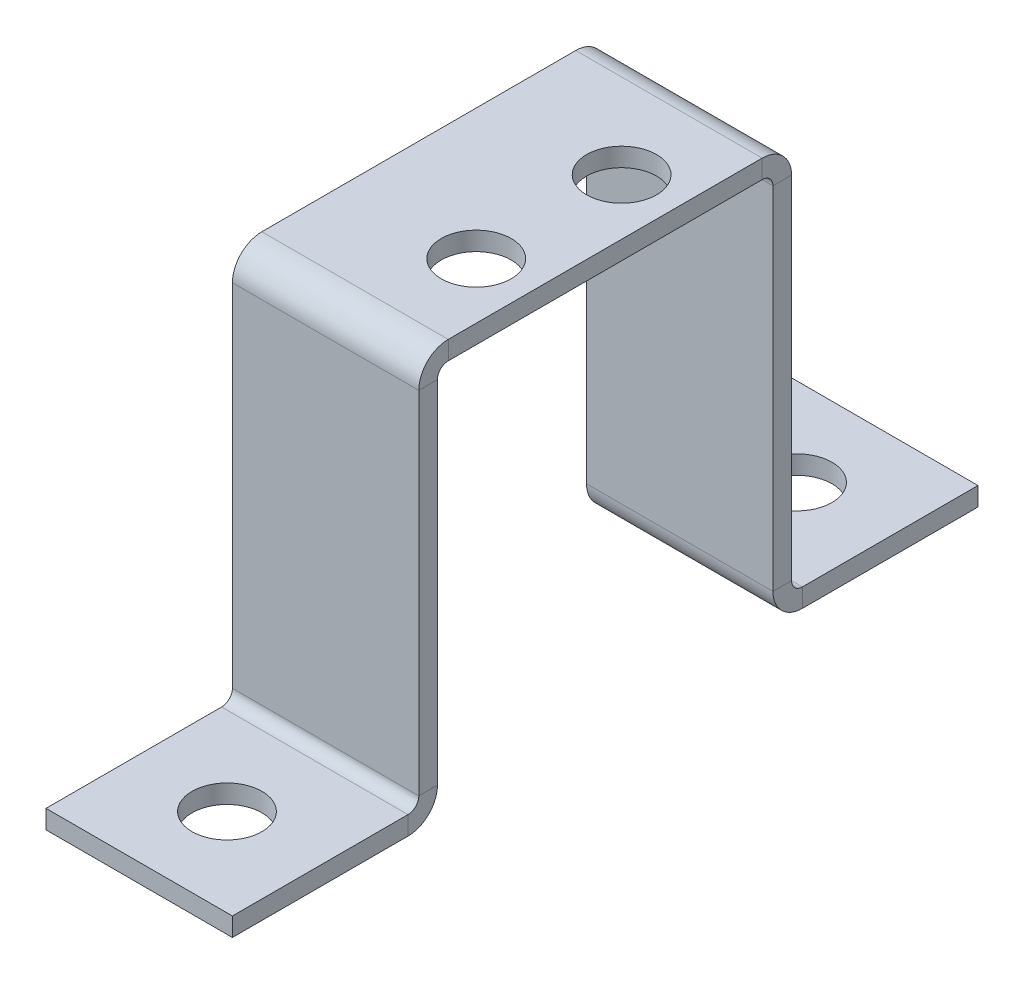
ISO-10303-21;
HEADER;
FILE_DESCRIPTION(('STEP AP214'),'2;1');
FILE_NAME('part.step','',(''),(''),'','','');
FILE_SCHEMA(('AUTOMOTIVE_DESIGN { 1 0 10303 214 1 1 1 1 }'));
ENDSEC;
DATA;
#1=APPLICATION_CONTEXT('core data for automotive mechanical design processes');
#2=APPLICATION_PROTOCOL_DEFINITION('international standard','automotive_design',2000,#1);
#3=PRODUCT_CONTEXT('',#1,'mechanical');
#4=PRODUCT('Part','Part','',(#3));
#5=PRODUCT_RELATED_PRODUCT_CATEGORY('part','',(#4));
#6=PRODUCT_DEFINITION_FORMATION('','',#4);
#7=PRODUCT_DEFINITION_CONTEXT('part definition',#1,'design');
#8=PRODUCT_DEFINITION('design','',#6,#7);
#9=PRODUCT_DEFINITION_SHAPE('','',#8);
#10=(LENGTH_UNIT() NAMED_UNIT(*) SI_UNIT(.MILLI.,.METRE.));
#11=(NAMED_UNIT(*) PLANE_ANGLE_UNIT() SI_UNIT($,.RADIAN.));
#12=(NAMED_UNIT(*) SI_UNIT($,.STERADIAN.) SOLID_ANGLE_UNIT());
#13=UNCERTAINTY_MEASURE_WITH_UNIT(LENGTH_MEASURE(1.E-05),#10,'distance_accuracy_value','');
#14=(GEOMETRIC_REPRESENTATION_CONTEXT(3) GLOBAL_UNCERTAINTY_ASSIGNED_CONTEXT((#13)) GLOBAL_UNIT_ASSIGNED_CONTEXT((#10,
#11,#12)) REPRESENTATION_CONTEXT('',''));
#15=CARTESIAN_POINT('',(0.,0.,0.));
#16=DIRECTION('',(0.,0.,1.));
#17=DIRECTION('',(1.,0.,0.));
#18=AXIS2_PLACEMENT_3D('',#15,#16,#17);
#19=CARTESIAN_POINT('',(0.,-27.94,0.));
#20=DIRECTION('',(0.,-1.,0.));
#21=DIRECTION('',(0.,0.,1.));
#22=AXIS2_PLACEMENT_3D('',#19,#20,#21);
#23=PLANE('',#22);
#24=DIRECTION('',(0.,0.,1.));
#25=VECTOR('',#24,1.);
#26=CARTESIAN_POINT('',(6.35,-27.94,-12.7000000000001));
#27=LINE('',#26,#25);
#28=CARTESIAN_POINT('',(6.35,-27.94,-25.4000000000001));
#29=VERTEX_POINT('',#28);
#30=CARTESIAN_POINT('',(6.35,-27.94,-13.4366000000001));
#31=VERTEX_POINT('',#30);
#32=EDGE_CURVE('E178',#29,#31,#27,.T.);
#33=ORIENTED_EDGE('',*,*,#32,.T.);
#34=DIRECTION('',(-1.,0.,0.));
#35=VECTOR('',#34,1.);
#36=CARTESIAN_POINT('',(0.,-27.94,-13.4366000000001));
#37=LINE('',#36,#35);
#38=CARTESIAN_POINT('',(-6.35,-27.94,-13.4366000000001));
#39=VERTEX_POINT('',#38);
#40=EDGE_CURVE('E202',#31,#39,#37,.T.);
#41=ORIENTED_EDGE('',*,*,#40,.T.);
#42=DIRECTION('',(0.,0.,-1.));
#43=VECTOR('',#42,1.);
#44=CARTESIAN_POINT('',(-6.35,-27.94,-25.4000000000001));
#45=LINE('',#44,#43);
#46=CARTESIAN_POINT('',(-6.35,-27.94,-25.4000000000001));
#47=VERTEX_POINT('',#46);
#48=EDGE_CURVE('E180',#39,#47,#45,.T.);
#49=ORIENTED_EDGE('',*,*,#48,.T.);
#50=DIRECTION('',(1.,0.,0.));
#51=VECTOR('',#50,1.);
#52=CARTESIAN_POINT('',(6.35,-27.94,-25.4000000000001));
#53=LINE('',#52,#51);
#54=EDGE_CURVE('E173',#47,#29,#53,.T.);
#55=ORIENTED_EDGE('',*,*,#54,.T.);
#56=EDGE_LOOP('',(#33,#41,#49,#55));
#57=FACE_BOUND('',#56,.T.);
#58=CARTESIAN_POINT('',(0.,-27.94,-19.4183000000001));
#59=DIRECTION('',(0.,-1.,0.));
#60=DIRECTION('',(0.,0.,-1.));
#61=AXIS2_PLACEMENT_3D('',#58,#59,#60);
#62=CIRCLE('',#61,2.38125);
#63=CARTESIAN_POINT('',(0.,-27.94,-21.7995500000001));
#64=VERTEX_POINT('',#63);
#65=EDGE_CURVE('E946',#64,#64,#62,.T.);
#66=ORIENTED_EDGE('',*,*,#65,.F.);
#67=EDGE_LOOP('',(#66));
#68=FACE_BOUND('',#67,.T.);
#69=ADVANCED_FACE('F35',(#57,#68),#23,.T.);
#70=CARTESIAN_POINT('',(0.,-26.67,0.));
#71=DIRECTION('',(0.,-1.,0.));
#72=DIRECTION('',(0.,0.,1.));
#73=AXIS2_PLACEMENT_3D('',#70,#71,#72);
#74=PLANE('',#73);
#75=DIRECTION('',(-1.,0.,0.));
#76=VECTOR('',#75,1.);
#77=CARTESIAN_POINT('',(6.35,-26.67,-13.4366000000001));
#78=LINE('',#77,#76);
#79=CARTESIAN_POINT('',(6.35,-26.67,-13.4366000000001));
#80=VERTEX_POINT('',#79);
#81=CARTESIAN_POINT('',(-6.35,-26.67,-13.4366000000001));
#82=VERTEX_POINT('',#81);
#83=EDGE_CURVE('E457',#80,#82,#78,.T.);
#84=ORIENTED_EDGE('',*,*,#83,.F.);
#85=DIRECTION('',(0.,0.,1.));
#86=VECTOR('',#85,1.);
#87=CARTESIAN_POINT('',(6.35,-26.67,-12.7000000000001));
#88=LINE('',#87,#86);
#89=CARTESIAN_POINT('',(6.35,-26.67,-25.4000000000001));
#90=VERTEX_POINT('',#89);
#91=EDGE_CURVE('E206',#90,#80,#88,.T.);
#92=ORIENTED_EDGE('',*,*,#91,.F.);
#93=DIRECTION('',(1.,0.,0.));
#94=VECTOR('',#93,1.);
#95=CARTESIAN_POINT('',(6.35,-26.67,-25.4000000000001));
#96=LINE('',#95,#94);
#97=CARTESIAN_POINT('',(-6.35,-26.67,-25.4000000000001));
#98=VERTEX_POINT('',#97);
#99=EDGE_CURVE('E189',#98,#90,#96,.T.);
#100=ORIENTED_EDGE('',*,*,#99,.F.);
#101=DIRECTION('',(0.,0.,-1.));
#102=VECTOR('',#101,1.);
#103=CARTESIAN_POINT('',(-6.35,-26.67,-25.4000000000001));
#104=LINE('',#103,#102);
#105=EDGE_CURVE('E198',#82,#98,#104,.T.);
#106=ORIENTED_EDGE('',*,*,#105,.F.);
#107=EDGE_LOOP('',(#84,#92,#100,#106));
#108=FACE_BOUND('',#107,.T.);
#109=CARTESIAN_POINT('',(0.,-26.67,-19.4183000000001));
#110=DIRECTION('',(0.,-1.,0.));
#111=DIRECTION('',(0.,0.,-1.));
#112=AXIS2_PLACEMENT_3D('',#109,#110,#111);
#113=CIRCLE('',#112,2.38125);
#114=CARTESIAN_POINT('',(0.,-26.67,-21.7995500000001));
#115=VERTEX_POINT('',#114);
#116=EDGE_CURVE('E940',#115,#115,#113,.T.);
#117=ORIENTED_EDGE('',*,*,#116,.T.);
#118=EDGE_LOOP('',(#117));
#119=FACE_BOUND('',#118,.T.);
#120=ADVANCED_FACE('F483',(#108,#119),#74,.F.);
#121=CARTESIAN_POINT('',(-6.35,-26.67,-12.7000000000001));
#122=DIRECTION('',(-1.,0.,0.));
#123=DIRECTION('',(0.,0.,1.));
#124=AXIS2_PLACEMENT_3D('',#121,#122,#123);
#125=PLANE('',#124);
#126=DIRECTION('',(0.,-1.,0.));
#127=VECTOR('',#126,1.);
#128=CARTESIAN_POINT('',(-6.35,-26.67,-12.7000000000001));
#129=LINE('',#128,#127);
#130=CARTESIAN_POINT('',(-6.35,-2.0066,-12.7));
#131=VERTEX_POINT('',#130);
#132=CARTESIAN_POINT('',(-6.35,-25.9334,-12.7000000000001));
#133=VERTEX_POINT('',#132);
#134=EDGE_CURVE('E242',#131,#133,#129,.T.);
#135=ORIENTED_EDGE('',*,*,#134,.T.);
#136=DIRECTION('',(0.,0.,1.));
#137=VECTOR('',#136,1.);
#138=CARTESIAN_POINT('',(-6.35,-25.9334,-12.7000000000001));
#139=LINE('',#138,#137);
#140=CARTESIAN_POINT('',(-6.35,-25.9334,-11.4300000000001));
#141=VERTEX_POINT('',#140);
#142=EDGE_CURVE('E216',#133,#141,#139,.T.);
#143=ORIENTED_EDGE('',*,*,#142,.T.);
#144=DIRECTION('',(0.,-1.,0.));
#145=VECTOR('',#144,1.);
#146=CARTESIAN_POINT('',(-6.35,-26.67,-11.4300000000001));
#147=LINE('',#146,#145);
#148=CARTESIAN_POINT('',(-6.35,-2.0066,-11.43));
#149=VERTEX_POINT('',#148);
#150=EDGE_CURVE('E241',#149,#141,#147,.T.);
#151=ORIENTED_EDGE('',*,*,#150,.F.);
#152=DIRECTION('',(0.,0.,-1.));
#153=VECTOR('',#152,1.);
#154=CARTESIAN_POINT('',(-6.35,-2.0066,-11.43));
#155=LINE('',#154,#153);
#156=EDGE_CURVE('E228',#149,#131,#155,.T.);
#157=ORIENTED_EDGE('',*,*,#156,.T.);
#158=EDGE_LOOP('',(#135,#143,#151,#157));
#159=FACE_BOUND('',#158,.T.);
#160=ADVANCED_FACE('F445',(#159),#125,.T.);
#161=CARTESIAN_POINT('',(0.,0.,-12.7));
#162=DIRECTION('',(0.,0.,1.));
#163=DIRECTION('',(0.,1.,0.));
#164=AXIS2_PLACEMENT_3D('',#161,#162,#163);
#165=PLANE('',#164);
#166=DIRECTION('',(-1.,0.,0.));
#167=VECTOR('',#166,1.);
#168=CARTESIAN_POINT('',(-6.35,-25.9334,-12.7000000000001));
#169=LINE('',#168,#167);
#170=CARTESIAN_POINT('',(6.35,-25.9334,-12.7000000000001));
#171=VERTEX_POINT('',#170);
#172=EDGE_CURVE('E222',#133,#171,#169,.F.);
#173=ORIENTED_EDGE('',*,*,#172,.F.);
#174=ORIENTED_EDGE('',*,*,#134,.F.);
#175=DIRECTION('',(-1.,0.,0.));
#176=VECTOR('',#175,1.);
#177=CARTESIAN_POINT('',(0.,-2.00659999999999,-12.7));
#178=LINE('',#177,#176);
#179=CARTESIAN_POINT('',(6.35,-2.00659999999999,-12.7));
#180=VERTEX_POINT('',#179);
#181=EDGE_CURVE('E237',#180,#131,#178,.T.);
#182=ORIENTED_EDGE('',*,*,#181,.F.);
#183=DIRECTION('',(0.,1.,0.));
#184=VECTOR('',#183,1.);
#185=CARTESIAN_POINT('',(6.35,-1.27,-12.7));
#186=LINE('',#185,#184);
#187=EDGE_CURVE('E245',#171,#180,#186,.T.);
#188=ORIENTED_EDGE('',*,*,#187,.F.);
#189=EDGE_LOOP('',(#173,#174,#182,#188));
#190=FACE_BOUND('',#189,.T.);
#191=ADVANCED_FACE('F460',(#190),#165,.F.);
#192=CARTESIAN_POINT('',(0.,0.,-11.43));
#193=DIRECTION('',(0.,0.,1.));
#194=DIRECTION('',(0.,1.,0.));
#195=AXIS2_PLACEMENT_3D('',#192,#193,#194);
#196=PLANE('',#195);
#197=ORIENTED_EDGE('',*,*,#150,.T.);
#198=DIRECTION('',(-1.,0.,0.));
#199=VECTOR('',#198,1.);
#200=CARTESIAN_POINT('',(-6.35,-25.9334,-11.4300000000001));
#201=LINE('',#200,#199);
#202=CARTESIAN_POINT('',(6.35,-25.9334,-11.4300000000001));
#203=VERTEX_POINT('',#202);
#204=EDGE_CURVE('E211',#141,#203,#201,.F.);
#205=ORIENTED_EDGE('',*,*,#204,.T.);
#206=DIRECTION('',(0.,1.,0.));
#207=VECTOR('',#206,1.);
#208=CARTESIAN_POINT('',(6.35,-1.27,-11.43));
#209=LINE('',#208,#207);
#210=CARTESIAN_POINT('',(6.35,-2.0066,-11.43));
#211=VERTEX_POINT('',#210);
#212=EDGE_CURVE('E246',#203,#211,#209,.T.);
#213=ORIENTED_EDGE('',*,*,#212,.T.);
#214=DIRECTION('',(1.,0.,0.));
#215=VECTOR('',#214,1.);
#216=CARTESIAN_POINT('',(-6.35,-2.0066,-11.43));
#217=LINE('',#216,#215);
#218=EDGE_CURVE('E231',#149,#211,#217,.T.);
#219=ORIENTED_EDGE('',*,*,#218,.F.);
#220=EDGE_LOOP('',(#197,#205,#213,#219));
#221=FACE_BOUND('',#220,.T.);
#222=ADVANCED_FACE('F442',(#221),#196,.T.);
#223=CARTESIAN_POINT('',(0.,-1.27,0.));
#224=DIRECTION('',(0.,-1.,0.));
#225=DIRECTION('',(0.,0.,-1.));
#226=AXIS2_PLACEMENT_3D('',#223,#224,#225);
#227=PLANE('',#226);
#228=CARTESIAN_POINT('',(2.54,-1.27,-4.9276));
#229=DIRECTION('',(0.,-1.,0.));
#230=DIRECTION('',(0.,0.,-1.));
#231=AXIS2_PLACEMENT_3D('',#228,#229,#230);
#232=CIRCLE('',#231,2.38125);
#233=CARTESIAN_POINT('',(2.54,-1.27,-7.30885));
#234=VERTEX_POINT('',#233);
#235=EDGE_CURVE('E937',#234,#234,#232,.F.);
#236=ORIENTED_EDGE('',*,*,#235,.T.);
#237=EDGE_LOOP('',(#236));
#238=FACE_BOUND('',#237,.T.);
#239=CARTESIAN_POINT('',(2.54,-1.27,4.9784));
#240=DIRECTION('',(0.,-1.,0.));
#241=DIRECTION('',(0.,0.,-1.));
#242=AXIS2_PLACEMENT_3D('',#239,#240,#241);
#243=CIRCLE('',#242,2.38125);
#244=CARTESIAN_POINT('',(2.54,-1.27,2.59715));
#245=VERTEX_POINT('',#244);
#246=EDGE_CURVE('E936',#245,#245,#243,.F.);
#247=ORIENTED_EDGE('',*,*,#246,.T.);
#248=EDGE_LOOP('',(#247));
#249=FACE_BOUND('',#248,.T.);
#250=DIRECTION('',(0.,0.,1.));
#251=VECTOR('',#250,1.);
#252=CARTESIAN_POINT('',(-6.35,-1.27,11.43));
#253=LINE('',#252,#251);
#254=CARTESIAN_POINT('',(-6.35,-1.27,-10.6934));
#255=VERTEX_POINT('',#254);
#256=CARTESIAN_POINT('',(-6.35,-1.27,10.6934));
#257=VERTEX_POINT('',#256);
#258=EDGE_CURVE('E11',#255,#257,#253,.T.);
#259=ORIENTED_EDGE('',*,*,#258,.F.);
#260=DIRECTION('',(1.,0.,0.));
#261=VECTOR('',#260,1.);
#262=CARTESIAN_POINT('',(6.35,-1.27,-10.6934));
#263=LINE('',#262,#261);
#264=CARTESIAN_POINT('',(6.35,-1.27,-10.6934));
#265=VERTEX_POINT('',#264);
#266=EDGE_CURVE('E264',#265,#255,#263,.F.);
#267=ORIENTED_EDGE('',*,*,#266,.F.);
#268=DIRECTION('',(0.,0.,-1.));
#269=VECTOR('',#268,1.);
#270=CARTESIAN_POINT('',(6.35,-1.27,11.43));
#271=LINE('',#270,#269);
#272=CARTESIAN_POINT('',(6.35,-1.27,10.6934));
#273=VERTEX_POINT('',#272);
#274=EDGE_CURVE('E44',#273,#265,#271,.T.);
#275=ORIENTED_EDGE('',*,*,#274,.F.);
#276=DIRECTION('',(-1.,0.,0.));
#277=VECTOR('',#276,1.);
#278=CARTESIAN_POINT('',(-6.35,-1.27,10.6934));
#279=LINE('',#278,#277);
#280=EDGE_CURVE('E366',#257,#273,#279,.F.);
#281=ORIENTED_EDGE('',*,*,#280,.F.);
#282=EDGE_LOOP('',(#259,#267,#275,#281));
#283=FACE_BOUND('',#282,.T.);
#284=ADVANCED_FACE('F428',(#238,#249,#283),#227,.T.);
#285=CARTESIAN_POINT('',(0.,0.,0.));
#286=DIRECTION('',(0.,-1.,0.));
#287=DIRECTION('',(0.,0.,-1.));
#288=AXIS2_PLACEMENT_3D('',#285,#286,#287);
#289=PLANE('',#288);
#290=CARTESIAN_POINT('',(2.54,0.,-4.9276));
#291=DIRECTION('',(0.,1.,0.));
#292=DIRECTION('',(0.,0.,1.));
#293=AXIS2_PLACEMENT_3D('',#290,#291,#292);
#294=CIRCLE('',#293,2.38125);
#295=CARTESIAN_POINT('',(2.54,0.,-2.54635));
#296=VERTEX_POINT('',#295);
#297=EDGE_CURVE('E932',#296,#296,#294,.T.);
#298=ORIENTED_EDGE('',*,*,#297,.F.);
#299=EDGE_LOOP('',(#298));
#300=FACE_BOUND('',#299,.T.);
#301=CARTESIAN_POINT('',(2.54,0.,4.9784));
#302=DIRECTION('',(0.,1.,0.));
#303=DIRECTION('',(0.,0.,1.));
#304=AXIS2_PLACEMENT_3D('',#301,#302,#303);
#305=CIRCLE('',#304,2.38125);
#306=CARTESIAN_POINT('',(2.54,0.,7.35965));
#307=VERTEX_POINT('',#306);
#308=EDGE_CURVE('E935',#307,#307,#305,.T.);
#309=ORIENTED_EDGE('',*,*,#308,.F.);
#310=EDGE_LOOP('',(#309));
#311=FACE_BOUND('',#310,.T.);
#312=DIRECTION('',(1.,0.,0.));
#313=VECTOR('',#312,1.);
#314=CARTESIAN_POINT('',(6.35,0.,-10.6934));
#315=LINE('',#314,#313);
#316=CARTESIAN_POINT('',(6.35,0.,-10.6934));
#317=VERTEX_POINT('',#316);
#318=CARTESIAN_POINT('',(-6.35,0.,-10.6934));
#319=VERTEX_POINT('',#318);
#320=EDGE_CURVE('E252',#317,#319,#315,.F.);
#321=ORIENTED_EDGE('',*,*,#320,.T.);
#322=DIRECTION('',(0.,0.,1.));
#323=VECTOR('',#322,1.);
#324=CARTESIAN_POINT('',(-6.35,0.,11.43));
#325=LINE('',#324,#323);
#326=CARTESIAN_POINT('',(-6.35,0.,10.6934));
#327=VERTEX_POINT('',#326);
#328=EDGE_CURVE('E39',#319,#327,#325,.T.);
#329=ORIENTED_EDGE('',*,*,#328,.T.);
#330=DIRECTION('',(-1.,0.,0.));
#331=VECTOR('',#330,1.);
#332=CARTESIAN_POINT('',(-6.35,0.,10.6934));
#333=LINE('',#332,#331);
#334=CARTESIAN_POINT('',(6.35,0.,10.6934));
#335=VERTEX_POINT('',#334);
#336=EDGE_CURVE('E354',#327,#335,#333,.F.);
#337=ORIENTED_EDGE('',*,*,#336,.T.);
#338=DIRECTION('',(0.,0.,-1.));
#339=VECTOR('',#338,1.);
#340=CARTESIAN_POINT('',(6.35,0.,11.43));
#341=LINE('',#340,#339);
#342=EDGE_CURVE('E374',#335,#317,#341,.T.);
#343=ORIENTED_EDGE('',*,*,#342,.T.);
#344=EDGE_LOOP('',(#321,#329,#337,#343));
#345=FACE_BOUND('',#344,.T.);
#346=ADVANCED_FACE('F381',(#300,#311,#345),#289,.F.);
#347=CARTESIAN_POINT('',(6.35,-1.27,11.43));
#348=DIRECTION('',(1.,0.,0.));
#349=DIRECTION('',(0.,0.,-1.));
#350=AXIS2_PLACEMENT_3D('',#347,#348,#349);
#351=PLANE('',#350);
#352=ORIENTED_EDGE('',*,*,#274,.T.);
#353=DIRECTION('',(0.,1.,0.));
#354=VECTOR('',#353,1.);
#355=CARTESIAN_POINT('',(6.35,-1.27,-10.6934));
#356=LINE('',#355,#354);
#357=EDGE_CURVE('E258',#265,#317,#356,.T.);
#358=ORIENTED_EDGE('',*,*,#357,.T.);
#359=ORIENTED_EDGE('',*,*,#342,.F.);
#360=DIRECTION('',(0.,1.,0.));
#361=VECTOR('',#360,1.);
#362=CARTESIAN_POINT('',(6.35,-1.27,10.6934));
#363=LINE('',#362,#361);
#364=EDGE_CURVE('E371',#273,#335,#363,.T.);
#365=ORIENTED_EDGE('',*,*,#364,.F.);
#366=EDGE_LOOP('',(#352,#358,#359,#365));
#367=FACE_BOUND('',#366,.T.);
#368=ADVANCED_FACE('F37',(#367),#351,.T.);
#369=CARTESIAN_POINT('',(-6.35,-26.67,12.7000000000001));
#370=DIRECTION('',(1.,0.,0.));
#371=DIRECTION('',(0.,0.,-1.));
#372=AXIS2_PLACEMENT_3D('',#369,#370,#371);
#373=PLANE('',#372);
#374=DIRECTION('',(0.,0.,-1.));
#375=VECTOR('',#374,1.);
#376=CARTESIAN_POINT('',(-6.35,-25.9334,12.7000000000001));
#377=LINE('',#376,#375);
#378=CARTESIAN_POINT('',(-6.35,-25.9334,12.7000000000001));
#379=VERTEX_POINT('',#378);
#380=CARTESIAN_POINT('',(-6.35,-25.9334,11.4300000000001));
#381=VERTEX_POINT('',#380);
#382=EDGE_CURVE('E328',#379,#381,#377,.T.);
#383=ORIENTED_EDGE('',*,*,#382,.F.);
#384=DIRECTION('',(0.,-1.,0.));
#385=VECTOR('',#384,1.);
#386=CARTESIAN_POINT('',(-6.35,-26.67,12.7000000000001));
#387=LINE('',#386,#385);
#388=CARTESIAN_POINT('',(-6.35,-2.0066,12.7));
#389=VERTEX_POINT('',#388);
#390=EDGE_CURVE('E344',#389,#379,#387,.T.);
#391=ORIENTED_EDGE('',*,*,#390,.F.);
#392=DIRECTION('',(0.,0.,1.));
#393=VECTOR('',#392,1.);
#394=CARTESIAN_POINT('',(-6.35,-2.0066,11.43));
#395=LINE('',#394,#393);
#396=CARTESIAN_POINT('',(-6.35,-2.00659999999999,11.43));
#397=VERTEX_POINT('',#396);
#398=EDGE_CURVE('E335',#397,#389,#395,.T.);
#399=ORIENTED_EDGE('',*,*,#398,.F.);
#400=DIRECTION('',(0.,-1.,0.));
#401=VECTOR('',#400,1.);
#402=CARTESIAN_POINT('',(-6.35,-26.67,11.4300000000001));
#403=LINE('',#402,#401);
#404=EDGE_CURVE('E343',#397,#381,#403,.T.);
#405=ORIENTED_EDGE('',*,*,#404,.T.);
#406=EDGE_LOOP('',(#383,#391,#399,#405));
#407=FACE_BOUND('',#406,.T.);
#408=ADVANCED_FACE('F405',(#407),#373,.F.);
#409=CARTESIAN_POINT('',(6.35,-1.27,12.7));
#410=DIRECTION('',(-1.,0.,0.));
#411=DIRECTION('',(0.,0.,1.));
#412=AXIS2_PLACEMENT_3D('',#409,#410,#411);
#413=PLANE('',#412);
#414=DIRECTION('',(0.,0.,-1.));
#415=VECTOR('',#414,1.);
#416=CARTESIAN_POINT('',(6.35,-25.9334,12.7000000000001));
#417=LINE('',#416,#415);
#418=CARTESIAN_POINT('',(6.35,-25.9334,12.7000000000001));
#419=VERTEX_POINT('',#418);
#420=CARTESIAN_POINT('',(6.35,-25.9334,11.4300000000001));
#421=VERTEX_POINT('',#420);
#422=EDGE_CURVE('E318',#419,#421,#417,.T.);
#423=ORIENTED_EDGE('',*,*,#422,.T.);
#424=DIRECTION('',(0.,1.,0.));
#425=VECTOR('',#424,1.);
#426=CARTESIAN_POINT('',(6.35,-1.27,11.43));
#427=LINE('',#426,#425);
#428=CARTESIAN_POINT('',(6.35,-2.00659999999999,11.43));
#429=VERTEX_POINT('',#428);
#430=EDGE_CURVE('E348',#421,#429,#427,.T.);
#431=ORIENTED_EDGE('',*,*,#430,.T.);
#432=DIRECTION('',(0.,0.,1.));
#433=VECTOR('',#432,1.);
#434=CARTESIAN_POINT('',(6.35,-2.0066,11.43));
#435=LINE('',#434,#433);
#436=CARTESIAN_POINT('',(6.35,-2.00659999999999,12.7));
#437=VERTEX_POINT('',#436);
#438=EDGE_CURVE('E330',#429,#437,#435,.T.);
#439=ORIENTED_EDGE('',*,*,#438,.T.);
#440=DIRECTION('',(0.,1.,0.));
#441=VECTOR('',#440,1.);
#442=CARTESIAN_POINT('',(6.35,-1.27,12.7));
#443=LINE('',#442,#441);
#444=EDGE_CURVE('E347',#419,#437,#443,.T.);
#445=ORIENTED_EDGE('',*,*,#444,.F.);
#446=EDGE_LOOP('',(#423,#431,#439,#445));
#447=FACE_BOUND('',#446,.T.);
#448=ADVANCED_FACE('F419',(#447),#413,.F.);
#449=CARTESIAN_POINT('',(0.,0.,12.7));
#450=DIRECTION('',(0.,0.,-1.));
#451=DIRECTION('',(0.,1.,0.));
#452=AXIS2_PLACEMENT_3D('',#449,#450,#451);
#453=PLANE('',#452);
#454=DIRECTION('',(1.,0.,0.));
#455=VECTOR('',#454,1.);
#456=CARTESIAN_POINT('',(6.35,-25.9334,12.7000000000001));
#457=LINE('',#456,#455);
#458=EDGE_CURVE('E324',#419,#379,#457,.F.);
#459=ORIENTED_EDGE('',*,*,#458,.F.);
#460=ORIENTED_EDGE('',*,*,#444,.T.);
#461=DIRECTION('',(1.,0.,0.));
#462=VECTOR('',#461,1.);
#463=CARTESIAN_POINT('',(0.,-2.0066,12.7));
#464=LINE('',#463,#462);
#465=EDGE_CURVE('E338',#389,#437,#464,.T.);
#466=ORIENTED_EDGE('',*,*,#465,.F.);
#467=ORIENTED_EDGE('',*,*,#390,.T.);
#468=EDGE_LOOP('',(#459,#460,#466,#467));
#469=FACE_BOUND('',#468,.T.);
#470=ADVANCED_FACE('F402',(#469),#453,.F.);
#471=CARTESIAN_POINT('',(0.,0.,11.43));
#472=DIRECTION('',(0.,0.,-1.));
#473=DIRECTION('',(0.,1.,0.));
#474=AXIS2_PLACEMENT_3D('',#471,#472,#473);
#475=PLANE('',#474);
#476=ORIENTED_EDGE('',*,*,#430,.F.);
#477=DIRECTION('',(1.,0.,0.));
#478=VECTOR('',#477,1.);
#479=CARTESIAN_POINT('',(6.35,-25.9334,11.4300000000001));
#480=LINE('',#479,#478);
#481=EDGE_CURVE('E313',#421,#381,#480,.F.);
#482=ORIENTED_EDGE('',*,*,#481,.T.);
#483=ORIENTED_EDGE('',*,*,#404,.F.);
#484=DIRECTION('',(-1.,0.,0.));
#485=VECTOR('',#484,1.);
#486=CARTESIAN_POINT('',(6.35,-2.0066,11.43));
#487=LINE('',#486,#485);
#488=EDGE_CURVE('E333',#429,#397,#487,.T.);
#489=ORIENTED_EDGE('',*,*,#488,.F.);
#490=EDGE_LOOP('',(#476,#482,#483,#489));
#491=FACE_BOUND('',#490,.T.);
#492=ADVANCED_FACE('F411',(#491),#475,.T.);
#493=CARTESIAN_POINT('',(-6.35,-1.27,11.43));
#494=DIRECTION('',(-1.,0.,0.));
#495=DIRECTION('',(0.,0.,1.));
#496=AXIS2_PLACEMENT_3D('',#493,#494,#495);
#497=PLANE('',#496);
#498=DIRECTION('',(0.,1.,0.));
#499=VECTOR('',#498,1.);
#500=CARTESIAN_POINT('',(-6.35,-1.27,-10.6934));
#501=LINE('',#500,#499);
#502=EDGE_CURVE('E269',#255,#319,#501,.T.);
#503=ORIENTED_EDGE('',*,*,#502,.F.);
#504=ORIENTED_EDGE('',*,*,#258,.T.);
#505=DIRECTION('',(0.,1.,0.));
#506=VECTOR('',#505,1.);
#507=CARTESIAN_POINT('',(-6.35,-1.27,10.6934));
#508=LINE('',#507,#506);
#509=EDGE_CURVE('E360',#257,#327,#508,.T.);
#510=ORIENTED_EDGE('',*,*,#509,.T.);
#511=ORIENTED_EDGE('',*,*,#328,.F.);
#512=EDGE_LOOP('',(#503,#504,#510,#511));
#513=FACE_BOUND('',#512,.T.);
#514=ADVANCED_FACE('F386',(#513),#497,.T.);
#515=CARTESIAN_POINT('',(6.35,-2.0066,10.6934));
#516=DIRECTION('',(1.,0.,0.));
#517=DIRECTION('',(0.,0.,-1.));
#518=AXIS2_PLACEMENT_3D('',#515,#516,#517);
#519=PLANE('',#518);
#520=ORIENTED_EDGE('',*,*,#438,.F.);
#521=CARTESIAN_POINT('',(6.35,-2.0066,10.6934));
#522=DIRECTION('',(-1.,0.,0.));
#523=DIRECTION('',(0.,0.,1.));
#524=AXIS2_PLACEMENT_3D('',#521,#522,#523);
#525=CIRCLE('',#524,0.7366);
#526=EDGE_CURVE('E363',#273,#429,#525,.F.);
#527=ORIENTED_EDGE('',*,*,#526,.F.);
#528=ORIENTED_EDGE('',*,*,#364,.T.);
#529=CARTESIAN_POINT('',(6.35,-2.0066,10.6934));
#530=DIRECTION('',(-1.,0.,0.));
#531=DIRECTION('',(0.,0.,1.));
#532=AXIS2_PLACEMENT_3D('',#529,#530,#531);
#533=CIRCLE('',#532,2.0066);
#534=EDGE_CURVE('E356',#335,#437,#533,.F.);
#535=ORIENTED_EDGE('',*,*,#534,.T.);
#536=EDGE_LOOP('',(#520,#527,#528,#535));
#537=FACE_BOUND('',#536,.T.);
#538=ADVANCED_FACE('F423',(#537),#519,.T.);
#539=CARTESIAN_POINT('',(-6.35,-2.0066,10.6934));
#540=DIRECTION('',(1.,0.,0.));
#541=DIRECTION('',(0.,0.,-1.));
#542=AXIS2_PLACEMENT_3D('',#539,#540,#541);
#543=PLANE('',#542);
#544=CARTESIAN_POINT('',(-6.35,-2.0066,10.6934));
#545=DIRECTION('',(-1.,0.,0.));
#546=DIRECTION('',(0.,0.,1.));
#547=AXIS2_PLACEMENT_3D('',#544,#545,#546);
#548=CIRCLE('',#547,0.7366);
#549=EDGE_CURVE('E350',#397,#257,#548,.T.);
#550=ORIENTED_EDGE('',*,*,#549,.F.);
#551=ORIENTED_EDGE('',*,*,#398,.T.);
#552=CARTESIAN_POINT('',(-6.35,-2.0066,10.6934));
#553=DIRECTION('',(-1.,0.,0.));
#554=DIRECTION('',(0.,0.,1.));
#555=AXIS2_PLACEMENT_3D('',#552,#553,#554);
#556=CIRCLE('',#555,2.0066);
#557=EDGE_CURVE('E357',#389,#327,#556,.T.);
#558=ORIENTED_EDGE('',*,*,#557,.T.);
#559=ORIENTED_EDGE('',*,*,#509,.F.);
#560=EDGE_LOOP('',(#550,#551,#558,#559));
#561=FACE_BOUND('',#560,.T.);
#562=ADVANCED_FACE('F394',(#561),#543,.F.);
#563=CARTESIAN_POINT('',(-6.35,-2.0066,10.6934));
#564=DIRECTION('',(-1.,0.,0.));
#565=DIRECTION('',(0.,0.,1.));
#566=AXIS2_PLACEMENT_3D('',#563,#564,#565);
#567=CYLINDRICAL_SURFACE('',#566,2.0066);
#568=ORIENTED_EDGE('',*,*,#336,.F.);
#569=ORIENTED_EDGE('',*,*,#557,.F.);
#570=ORIENTED_EDGE('',*,*,#465,.T.);
#571=ORIENTED_EDGE('',*,*,#534,.F.);
#572=EDGE_LOOP('',(#568,#569,#570,#571));
#573=FACE_BOUND('',#572,.T.);
#574=ADVANCED_FACE('F393',(#573),#567,.T.);
#575=CARTESIAN_POINT('',(-6.35,-2.0066,10.6934));
#576=DIRECTION('',(-1.,0.,0.));
#577=DIRECTION('',(0.,0.,1.));
#578=AXIS2_PLACEMENT_3D('',#575,#576,#577);
#579=CYLINDRICAL_SURFACE('',#578,0.7366);
#580=ORIENTED_EDGE('',*,*,#280,.T.);
#581=ORIENTED_EDGE('',*,*,#526,.T.);
#582=ORIENTED_EDGE('',*,*,#488,.T.);
#583=ORIENTED_EDGE('',*,*,#549,.T.);
#584=EDGE_LOOP('',(#580,#581,#582,#583));
#585=FACE_BOUND('',#584,.T.);
#586=ADVANCED_FACE('F425',(#585),#579,.F.);
#587=CARTESIAN_POINT('',(-6.35,-25.9334,13.4366000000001));
#588=DIRECTION('',(-1.,0.,0.));
#589=DIRECTION('',(0.,0.,1.));
#590=AXIS2_PLACEMENT_3D('',#587,#588,#589);
#591=PLANE('',#590);
#592=DIRECTION('',(0.,-1.,0.));
#593=VECTOR('',#592,1.);
#594=CARTESIAN_POINT('',(-6.35,-26.67,13.4366000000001));
#595=LINE('',#594,#593);
#596=CARTESIAN_POINT('',(-6.35,-26.67,13.4366000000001));
#597=VERTEX_POINT('',#596);
#598=CARTESIAN_POINT('',(-6.35,-27.94,13.4366000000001));
#599=VERTEX_POINT('',#598);
#600=EDGE_CURVE('E278',#597,#599,#595,.T.);
#601=ORIENTED_EDGE('',*,*,#600,.F.);
#602=CARTESIAN_POINT('',(-6.35,-25.9334,13.4366000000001));
#603=DIRECTION('',(1.,0.,0.));
#604=DIRECTION('',(0.,0.,-1.));
#605=AXIS2_PLACEMENT_3D('',#602,#603,#604);
#606=CIRCLE('',#605,0.736599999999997);
#607=EDGE_CURVE('E321',#379,#597,#606,.F.);
#608=ORIENTED_EDGE('',*,*,#607,.F.);
#609=ORIENTED_EDGE('',*,*,#382,.T.);
#610=CARTESIAN_POINT('',(-6.35,-25.9334,13.4366000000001));
#611=DIRECTION('',(1.,0.,0.));
#612=DIRECTION('',(0.,0.,-1.));
#613=AXIS2_PLACEMENT_3D('',#610,#611,#612);
#614=CIRCLE('',#613,2.0066);
#615=EDGE_CURVE('E60',#381,#599,#614,.F.);
#616=ORIENTED_EDGE('',*,*,#615,.T.);
#617=EDGE_LOOP('',(#601,#608,#609,#616));
#618=FACE_BOUND('',#617,.T.);
#619=ADVANCED_FACE('F408',(#618),#591,.T.);
#620=CARTESIAN_POINT('',(6.35,-25.9334,13.4366000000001));
#621=DIRECTION('',(-1.,0.,0.));
#622=DIRECTION('',(0.,0.,1.));
#623=AXIS2_PLACEMENT_3D('',#620,#621,#622);
#624=PLANE('',#623);
#625=CARTESIAN_POINT('',(6.35,-25.9334,13.4366000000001));
#626=DIRECTION('',(1.,0.,0.));
#627=DIRECTION('',(0.,0.,-1.));
#628=AXIS2_PLACEMENT_3D('',#625,#626,#627);
#629=CIRCLE('',#628,0.736599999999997);
#630=CARTESIAN_POINT('',(6.35,-26.67,13.4366000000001));
#631=VERTEX_POINT('',#630);
#632=EDGE_CURVE('E310',#631,#419,#629,.T.);
#633=ORIENTED_EDGE('',*,*,#632,.F.);
#634=DIRECTION('',(0.,-1.,0.));
#635=VECTOR('',#634,1.);
#636=CARTESIAN_POINT('',(6.35,-26.67,13.4366000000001));
#637=LINE('',#636,#635);
#638=CARTESIAN_POINT('',(6.35,-27.94,13.4366000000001));
#639=VERTEX_POINT('',#638);
#640=EDGE_CURVE('E283',#631,#639,#637,.T.);
#641=ORIENTED_EDGE('',*,*,#640,.T.);
#642=CARTESIAN_POINT('',(6.35,-25.9334,13.4366000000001));
#643=DIRECTION('',(1.,0.,0.));
#644=DIRECTION('',(0.,0.,-1.));
#645=AXIS2_PLACEMENT_3D('',#642,#643,#644);
#646=CIRCLE('',#645,2.0066);
#647=EDGE_CURVE('E316',#639,#421,#646,.T.);
#648=ORIENTED_EDGE('',*,*,#647,.T.);
#649=ORIENTED_EDGE('',*,*,#422,.F.);
#650=EDGE_LOOP('',(#633,#641,#648,#649));
#651=FACE_BOUND('',#650,.T.);
#652=ADVANCED_FACE('F416',(#651),#624,.F.);
#653=CARTESIAN_POINT('',(6.35,-25.9334,13.4366000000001));
#654=DIRECTION('',(1.,0.,0.));
#655=DIRECTION('',(0.,-1.,0.));
#656=AXIS2_PLACEMENT_3D('',#653,#654,#655);
#657=CYLINDRICAL_SURFACE('',#656,2.0066);
#658=ORIENTED_EDGE('',*,*,#481,.F.);
#659=ORIENTED_EDGE('',*,*,#647,.F.);
#660=DIRECTION('',(1.,0.,0.));
#661=VECTOR('',#660,1.);
#662=CARTESIAN_POINT('',(0.,-27.94,13.4366000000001));
#663=LINE('',#662,#661);
#664=EDGE_CURVE('E286',#599,#639,#663,.T.);
#665=ORIENTED_EDGE('',*,*,#664,.F.);
#666=ORIENTED_EDGE('',*,*,#615,.F.);
#667=EDGE_LOOP('',(#658,#659,#665,#666));
#668=FACE_BOUND('',#667,.T.);
#669=ADVANCED_FACE('F413',(#668),#657,.T.);
#670=CARTESIAN_POINT('',(6.35,-25.9334,13.4366000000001));
#671=DIRECTION('',(1.,0.,0.));
#672=DIRECTION('',(0.,-1.,0.));
#673=AXIS2_PLACEMENT_3D('',#670,#671,#672);
#674=CYLINDRICAL_SURFACE('',#673,0.736599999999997);
#675=ORIENTED_EDGE('',*,*,#458,.T.);
#676=ORIENTED_EDGE('',*,*,#607,.T.);
#677=DIRECTION('',(1.,0.,0.));
#678=VECTOR('',#677,1.);
#679=CARTESIAN_POINT('',(-6.35,-26.67,13.4366000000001));
#680=LINE('',#679,#678);
#681=EDGE_CURVE('E281',#597,#631,#680,.T.);
#682=ORIENTED_EDGE('',*,*,#681,.T.);
#683=ORIENTED_EDGE('',*,*,#632,.T.);
#684=EDGE_LOOP('',(#675,#676,#682,#683));
#685=FACE_BOUND('',#684,.T.);
#686=ADVANCED_FACE('F764',(#685),#674,.F.);
#687=CARTESIAN_POINT('',(6.35,-27.94,12.7000000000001));
#688=DIRECTION('',(1.,0.,0.));
#689=DIRECTION('',(0.,0.,-1.));
#690=AXIS2_PLACEMENT_3D('',#687,#688,#689);
#691=PLANE('',#690);
#692=DIRECTION('',(0.,0.,-1.));
#693=VECTOR('',#692,1.);
#694=CARTESIAN_POINT('',(6.35,-27.94,12.7000000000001));
#695=LINE('',#694,#693);
#696=CARTESIAN_POINT('',(6.35,-27.94,25.4000000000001));
#697=VERTEX_POINT('',#696);
#698=EDGE_CURVE('E298',#697,#639,#695,.T.);
#699=ORIENTED_EDGE('',*,*,#698,.T.);
#700=ORIENTED_EDGE('',*,*,#640,.F.);
#701=DIRECTION('',(0.,0.,-1.));
#702=VECTOR('',#701,1.);
#703=CARTESIAN_POINT('',(6.35,-26.67,12.7000000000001));
#704=LINE('',#703,#702);
#705=CARTESIAN_POINT('',(6.35,-26.67,25.4000000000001));
#706=VERTEX_POINT('',#705);
#707=EDGE_CURVE('E295',#706,#631,#704,.T.);
#708=ORIENTED_EDGE('',*,*,#707,.F.);
#709=DIRECTION('',(0.,1.,0.));
#710=VECTOR('',#709,1.);
#711=CARTESIAN_POINT('',(6.35,-27.94,25.4000000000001));
#712=LINE('',#711,#710);
#713=EDGE_CURVE('E308',#697,#706,#712,.T.);
#714=ORIENTED_EDGE('',*,*,#713,.F.);
#715=EDGE_LOOP('',(#699,#700,#708,#714));
#716=FACE_BOUND('',#715,.T.);
#717=ADVANCED_FACE('F753',(#716),#691,.T.);
#718=CARTESIAN_POINT('',(-6.35,-27.94,25.4000000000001));
#719=DIRECTION('',(-1.,0.,0.));
#720=DIRECTION('',(0.,0.,1.));
#721=AXIS2_PLACEMENT_3D('',#718,#719,#720);
#722=PLANE('',#721);
#723=DIRECTION('',(0.,0.,1.));
#724=VECTOR('',#723,1.);
#725=CARTESIAN_POINT('',(-6.35,-26.67,25.4000000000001));
#726=LINE('',#725,#724);
#727=CARTESIAN_POINT('',(-6.35,-26.67,25.4000000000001));
#728=VERTEX_POINT('',#727);
#729=EDGE_CURVE('E291',#597,#728,#726,.T.);
#730=ORIENTED_EDGE('',*,*,#729,.F.);
#731=ORIENTED_EDGE('',*,*,#600,.T.);
#732=DIRECTION('',(0.,0.,1.));
#733=VECTOR('',#732,1.);
#734=CARTESIAN_POINT('',(-6.35,-27.94,25.4000000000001));
#735=LINE('',#734,#733);
#736=CARTESIAN_POINT('',(-6.35,-27.94,25.4000000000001));
#737=VERTEX_POINT('',#736);
#738=EDGE_CURVE('E292',#599,#737,#735,.T.);
#739=ORIENTED_EDGE('',*,*,#738,.T.);
#740=DIRECTION('',(0.,1.,0.));
#741=VECTOR('',#740,1.);
#742=CARTESIAN_POINT('',(-6.35,-27.94,25.4000000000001));
#743=LINE('',#742,#741);
#744=EDGE_CURVE('E301',#737,#728,#743,.T.);
#745=ORIENTED_EDGE('',*,*,#744,.T.);
#746=EDGE_LOOP('',(#730,#731,#739,#745));
#747=FACE_BOUND('',#746,.T.);
#748=ADVANCED_FACE('F743',(#747),#722,.T.);
#749=CARTESIAN_POINT('',(0.,-27.94,0.));
#750=DIRECTION('',(0.,-1.,0.));
#751=DIRECTION('',(0.,0.,-1.));
#752=AXIS2_PLACEMENT_3D('',#749,#750,#751);
#753=PLANE('',#752);
#754=CARTESIAN_POINT('',(0.,-27.94,19.4183000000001));
#755=DIRECTION('',(0.,1.,0.));
#756=DIRECTION('',(0.,0.,1.));
#757=AXIS2_PLACEMENT_3D('',#754,#755,#756);
#758=CIRCLE('',#757,2.38125);
#759=CARTESIAN_POINT('',(0.,-27.94,21.7995500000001));
#760=VERTEX_POINT('',#759);
#761=EDGE_CURVE('E275',#760,#760,#758,.T.);
#762=ORIENTED_EDGE('',*,*,#761,.T.);
#763=EDGE_LOOP('',(#762));
#764=FACE_BOUND('',#763,.T.);
#765=ORIENTED_EDGE('',*,*,#738,.F.);
#766=ORIENTED_EDGE('',*,*,#664,.T.);
#767=ORIENTED_EDGE('',*,*,#698,.F.);
#768=DIRECTION('',(1.,0.,0.));
#769=VECTOR('',#768,1.);
#770=CARTESIAN_POINT('',(6.35,-27.94,25.4000000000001));
#771=LINE('',#770,#769);
#772=EDGE_CURVE('E294',#737,#697,#771,.T.);
#773=ORIENTED_EDGE('',*,*,#772,.F.);
#774=EDGE_LOOP('',(#765,#766,#767,#773));
#775=FACE_BOUND('',#774,.T.);
#776=ADVANCED_FACE('F733',(#764,#775),#753,.T.);
#777=CARTESIAN_POINT('',(0.,-26.67,0.));
#778=DIRECTION('',(0.,-1.,0.));
#779=DIRECTION('',(0.,0.,-1.));
#780=AXIS2_PLACEMENT_3D('',#777,#778,#779);
#781=PLANE('',#780);
#782=CARTESIAN_POINT('',(0.,-26.67,19.4183000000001));
#783=DIRECTION('',(0.,1.,0.));
#784=DIRECTION('',(0.,0.,1.));
#785=AXIS2_PLACEMENT_3D('',#782,#783,#784);
#786=CIRCLE('',#785,2.38125);
#787=CARTESIAN_POINT('',(0.,-26.67,21.7995500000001));
#788=VERTEX_POINT('',#787);
#789=EDGE_CURVE('E272',#788,#788,#786,.T.);
#790=ORIENTED_EDGE('',*,*,#789,.F.);
#791=EDGE_LOOP('',(#790));
#792=FACE_BOUND('',#791,.T.);
#793=ORIENTED_EDGE('',*,*,#681,.F.);
#794=ORIENTED_EDGE('',*,*,#729,.T.);
#795=DIRECTION('',(1.,0.,0.));
#796=VECTOR('',#795,1.);
#797=CARTESIAN_POINT('',(6.35,-26.67,25.4000000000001));
#798=LINE('',#797,#796);
#799=EDGE_CURVE('E303',#728,#706,#798,.T.);
#800=ORIENTED_EDGE('',*,*,#799,.T.);
#801=ORIENTED_EDGE('',*,*,#707,.T.);
#802=EDGE_LOOP('',(#793,#794,#800,#801));
#803=FACE_BOUND('',#802,.T.);
#804=ADVANCED_FACE('F721',(#792,#803),#781,.F.);
#805=CARTESIAN_POINT('',(6.35,-27.94,25.4000000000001));
#806=DIRECTION('',(0.,0.,1.));
#807=DIRECTION('',(0.,-1.,0.));
#808=AXIS2_PLACEMENT_3D('',#805,#806,#807);
#809=PLANE('',#808);
#810=ORIENTED_EDGE('',*,*,#799,.F.);
#811=ORIENTED_EDGE('',*,*,#744,.F.);
#812=ORIENTED_EDGE('',*,*,#772,.T.);
#813=ORIENTED_EDGE('',*,*,#713,.T.);
#814=EDGE_LOOP('',(#810,#811,#812,#813));
#815=FACE_BOUND('',#814,.T.);
#816=ADVANCED_FACE('F478',(#815),#809,.T.);
#817=CARTESIAN_POINT('',(0.,-27.94,19.4183000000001));
#818=DIRECTION('',(0.,1.,0.));
#819=DIRECTION('',(0.,0.,1.));
#820=AXIS2_PLACEMENT_3D('',#817,#818,#819);
#821=CYLINDRICAL_SURFACE('',#820,2.38125);
#822=ORIENTED_EDGE('',*,*,#761,.F.);
#823=EDGE_LOOP('',(#822));
#824=FACE_BOUND('',#823,.T.);
#825=ORIENTED_EDGE('',*,*,#789,.T.);
#826=EDGE_LOOP('',(#825));
#827=FACE_BOUND('',#826,.T.);
#828=ADVANCED_FACE('F471',(#824,#827),#821,.F.);
#829=CARTESIAN_POINT('',(-6.35,-2.0066,-10.6934));
#830=DIRECTION('',(-1.,0.,0.));
#831=DIRECTION('',(0.,0.,1.));
#832=AXIS2_PLACEMENT_3D('',#829,#830,#831);
#833=PLANE('',#832);
#834=ORIENTED_EDGE('',*,*,#156,.F.);
#835=CARTESIAN_POINT('',(-6.35,-2.0066,-10.6934));
#836=DIRECTION('',(1.,0.,0.));
#837=DIRECTION('',(0.,0.,-1.));
#838=AXIS2_PLACEMENT_3D('',#835,#836,#837);
#839=CIRCLE('',#838,0.7366);
#840=EDGE_CURVE('E261',#255,#149,#839,.F.);
#841=ORIENTED_EDGE('',*,*,#840,.F.);
#842=ORIENTED_EDGE('',*,*,#502,.T.);
#843=CARTESIAN_POINT('',(-6.35,-2.0066,-10.6934));
#844=DIRECTION('',(1.,0.,0.));
#845=DIRECTION('',(0.,0.,-1.));
#846=AXIS2_PLACEMENT_3D('',#843,#844,#845);
#847=CIRCLE('',#846,2.0066);
#848=EDGE_CURVE('E254',#319,#131,#847,.F.);
#849=ORIENTED_EDGE('',*,*,#848,.T.);
#850=EDGE_LOOP('',(#834,#841,#842,#849));
#851=FACE_BOUND('',#850,.T.);
#852=ADVANCED_FACE('F469',(#851),#833,.T.);
#853=CARTESIAN_POINT('',(6.35,-2.0066,-10.6934));
#854=DIRECTION('',(-1.,0.,0.));
#855=DIRECTION('',(0.,0.,1.));
#856=AXIS2_PLACEMENT_3D('',#853,#854,#855);
#857=PLANE('',#856);
#858=CARTESIAN_POINT('',(6.35,-2.0066,-10.6934));
#859=DIRECTION('',(1.,0.,0.));
#860=DIRECTION('',(0.,0.,-1.));
#861=AXIS2_PLACEMENT_3D('',#858,#859,#860);
#862=CIRCLE('',#861,0.7366);
#863=EDGE_CURVE('E248',#211,#265,#862,.T.);
#864=ORIENTED_EDGE('',*,*,#863,.F.);
#865=DIRECTION('',(0.,0.,-1.));
#866=VECTOR('',#865,1.);
#867=CARTESIAN_POINT('',(6.35,-2.0066,-11.43));
#868=LINE('',#867,#866);
#869=EDGE_CURVE('E234',#211,#180,#868,.T.);
#870=ORIENTED_EDGE('',*,*,#869,.T.);
#871=CARTESIAN_POINT('',(6.35,-2.0066,-10.6934));
#872=DIRECTION('',(1.,0.,0.));
#873=DIRECTION('',(0.,0.,-1.));
#874=AXIS2_PLACEMENT_3D('',#871,#872,#873);
#875=CIRCLE('',#874,2.0066);
#876=EDGE_CURVE('E255',#180,#317,#875,.T.);
#877=ORIENTED_EDGE('',*,*,#876,.T.);
#878=ORIENTED_EDGE('',*,*,#357,.F.);
#879=EDGE_LOOP('',(#864,#870,#877,#878));
#880=FACE_BOUND('',#879,.T.);
#881=ADVANCED_FACE('F433',(#880),#857,.F.);
#882=CARTESIAN_POINT('',(6.35,-2.0066,-10.6934));
#883=DIRECTION('',(1.,0.,0.));
#884=DIRECTION('',(0.,0.,-1.));
#885=AXIS2_PLACEMENT_3D('',#882,#883,#884);
#886=CYLINDRICAL_SURFACE('',#885,2.0066);
#887=ORIENTED_EDGE('',*,*,#320,.F.);
#888=ORIENTED_EDGE('',*,*,#876,.F.);
#889=ORIENTED_EDGE('',*,*,#181,.T.);
#890=ORIENTED_EDGE('',*,*,#848,.F.);
#891=EDGE_LOOP('',(#887,#888,#889,#890));
#892=FACE_BOUND('',#891,.T.);
#893=ADVANCED_FACE('F466',(#892),#886,.T.);
#894=CARTESIAN_POINT('',(6.35,-2.0066,-10.6934));
#895=DIRECTION('',(1.,0.,0.));
#896=DIRECTION('',(0.,0.,-1.));
#897=AXIS2_PLACEMENT_3D('',#894,#895,#896);
#898=CYLINDRICAL_SURFACE('',#897,0.7366);
#899=ORIENTED_EDGE('',*,*,#266,.T.);
#900=ORIENTED_EDGE('',*,*,#840,.T.);
#901=ORIENTED_EDGE('',*,*,#218,.T.);
#902=ORIENTED_EDGE('',*,*,#863,.T.);
#903=EDGE_LOOP('',(#899,#900,#901,#902));
#904=FACE_BOUND('',#903,.T.);
#905=ADVANCED_FACE('F437',(#904),#898,.F.);
#906=CARTESIAN_POINT('',(6.35,-1.27,-12.7));
#907=DIRECTION('',(1.,0.,0.));
#908=DIRECTION('',(0.,0.,-1.));
#909=AXIS2_PLACEMENT_3D('',#906,#907,#908);
#910=PLANE('',#909);
#911=DIRECTION('',(0.,0.,1.));
#912=VECTOR('',#911,1.);
#913=CARTESIAN_POINT('',(6.35,-25.9334,-12.7000000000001));
#914=LINE('',#913,#912);
#915=EDGE_CURVE('E226',#171,#203,#914,.T.);
#916=ORIENTED_EDGE('',*,*,#915,.F.);
#917=ORIENTED_EDGE('',*,*,#187,.T.);
#918=ORIENTED_EDGE('',*,*,#869,.F.);
#919=ORIENTED_EDGE('',*,*,#212,.F.);
#920=EDGE_LOOP('',(#916,#917,#918,#919));
#921=FACE_BOUND('',#920,.T.);
#922=ADVANCED_FACE('F464',(#921),#910,.T.);
#923=CARTESIAN_POINT('',(6.35,-25.9334,-13.4366000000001));
#924=DIRECTION('',(1.,0.,0.));
#925=DIRECTION('',(0.,0.,-1.));
#926=AXIS2_PLACEMENT_3D('',#923,#924,#925);
#927=PLANE('',#926);
#928=DIRECTION('',(0.,-1.,0.));
#929=VECTOR('',#928,1.);
#930=CARTESIAN_POINT('',(6.35,-26.67,-13.4366000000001));
#931=LINE('',#930,#929);
#932=EDGE_CURVE('E197',#80,#31,#931,.T.);
#933=ORIENTED_EDGE('',*,*,#932,.F.);
#934=CARTESIAN_POINT('',(6.35,-25.9334,-13.4366000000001));
#935=DIRECTION('',(-1.,0.,0.));
#936=DIRECTION('',(0.,0.,1.));
#937=AXIS2_PLACEMENT_3D('',#934,#935,#936);
#938=CIRCLE('',#937,0.736599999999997);
#939=EDGE_CURVE('E219',#171,#80,#938,.F.);
#940=ORIENTED_EDGE('',*,*,#939,.F.);
#941=ORIENTED_EDGE('',*,*,#915,.T.);
#942=CARTESIAN_POINT('',(6.35,-25.9334,-13.4366000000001));
#943=DIRECTION('',(-1.,0.,0.));
#944=DIRECTION('',(0.,0.,1.));
#945=AXIS2_PLACEMENT_3D('',#942,#943,#944);
#946=CIRCLE('',#945,2.0066);
#947=EDGE_CURVE('E52',#203,#31,#946,.F.);
#948=ORIENTED_EDGE('',*,*,#947,.T.);
#949=EDGE_LOOP('',(#933,#940,#941,#948));
#950=FACE_BOUND('',#949,.T.);
#951=ADVANCED_FACE('F507',(#950),#927,.T.);
#952=CARTESIAN_POINT('',(-6.35,-25.9334,-13.4366000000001));
#953=DIRECTION('',(1.,0.,0.));
#954=DIRECTION('',(0.,0.,-1.));
#955=AXIS2_PLACEMENT_3D('',#952,#953,#954);
#956=PLANE('',#955);
#957=CARTESIAN_POINT('',(-6.35,-25.9334,-13.4366000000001));
#958=DIRECTION('',(-1.,0.,0.));
#959=DIRECTION('',(0.,0.,1.));
#960=AXIS2_PLACEMENT_3D('',#957,#958,#959);
#961=CIRCLE('',#960,0.736599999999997);
#962=EDGE_CURVE('E209',#82,#133,#961,.T.);
#963=ORIENTED_EDGE('',*,*,#962,.F.);
#964=DIRECTION('',(0.,-1.,0.));
#965=VECTOR('',#964,1.);
#966=CARTESIAN_POINT('',(-6.35,-26.67,-13.4366000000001));
#967=LINE('',#966,#965);
#968=EDGE_CURVE('E952',#82,#39,#967,.T.);
#969=ORIENTED_EDGE('',*,*,#968,.T.);
#970=CARTESIAN_POINT('',(-6.35,-25.9334,-13.4366000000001));
#971=DIRECTION('',(-1.,0.,0.));
#972=DIRECTION('',(0.,0.,1.));
#973=AXIS2_PLACEMENT_3D('',#970,#971,#972);
#974=CIRCLE('',#973,2.0066);
#975=EDGE_CURVE('E214',#39,#141,#974,.T.);
#976=ORIENTED_EDGE('',*,*,#975,.T.);
#977=ORIENTED_EDGE('',*,*,#142,.F.);
#978=EDGE_LOOP('',(#963,#969,#976,#977));
#979=FACE_BOUND('',#978,.T.);
#980=ADVANCED_FACE('F449',(#979),#956,.F.);
#981=CARTESIAN_POINT('',(-6.35,-25.9334,-13.4366000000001));
#982=DIRECTION('',(-1.,0.,0.));
#983=DIRECTION('',(0.,-1.,0.));
#984=AXIS2_PLACEMENT_3D('',#981,#982,#983);
#985=CYLINDRICAL_SURFACE('',#984,2.0066);
#986=ORIENTED_EDGE('',*,*,#204,.F.);
#987=ORIENTED_EDGE('',*,*,#975,.F.);
#988=ORIENTED_EDGE('',*,*,#40,.F.);
#989=ORIENTED_EDGE('',*,*,#947,.F.);
#990=EDGE_LOOP('',(#986,#987,#988,#989));
#991=FACE_BOUND('',#990,.T.);
#992=ADVANCED_FACE('F502',(#991),#985,.T.);
#993=CARTESIAN_POINT('',(-6.35,-25.9334,-13.4366000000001));
#994=DIRECTION('',(-1.,0.,0.));
#995=DIRECTION('',(0.,-1.,0.));
#996=AXIS2_PLACEMENT_3D('',#993,#994,#995);
#997=CYLINDRICAL_SURFACE('',#996,0.736599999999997);
#998=ORIENTED_EDGE('',*,*,#172,.T.);
#999=ORIENTED_EDGE('',*,*,#939,.T.);
#1000=ORIENTED_EDGE('',*,*,#83,.T.);
#1001=ORIENTED_EDGE('',*,*,#962,.T.);
#1002=EDGE_LOOP('',(#998,#999,#1000,#1001));
#1003=FACE_BOUND('',#1002,.T.);
#1004=ADVANCED_FACE('F454',(#1003),#997,.F.);
#1005=CARTESIAN_POINT('',(-6.35,-27.94,-25.4000000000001));
#1006=DIRECTION('',(1.,0.,0.));
#1007=DIRECTION('',(0.,0.,-1.));
#1008=AXIS2_PLACEMENT_3D('',#1005,#1006,#1007);
#1009=PLANE('',#1008);
#1010=ORIENTED_EDGE('',*,*,#968,.F.);
#1011=ORIENTED_EDGE('',*,*,#105,.T.);
#1012=DIRECTION('',(0.,1.,0.));
#1013=VECTOR('',#1012,1.);
#1014=CARTESIAN_POINT('',(-6.35,-27.94,-25.4000000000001));
#1015=LINE('',#1014,#1013);
#1016=EDGE_CURVE('E193',#47,#98,#1015,.T.);
#1017=ORIENTED_EDGE('',*,*,#1016,.F.);
#1018=ORIENTED_EDGE('',*,*,#48,.F.);
#1019=EDGE_LOOP('',(#1010,#1011,#1017,#1018));
#1020=FACE_BOUND('',#1019,.T.);
#1021=ADVANCED_FACE('F494',(#1020),#1009,.F.);
#1022=CARTESIAN_POINT('',(6.35,-27.94,-12.7000000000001));
#1023=DIRECTION('',(-1.,0.,0.));
#1024=DIRECTION('',(0.,0.,1.));
#1025=AXIS2_PLACEMENT_3D('',#1022,#1023,#1024);
#1026=PLANE('',#1025);
#1027=ORIENTED_EDGE('',*,*,#932,.T.);
#1028=ORIENTED_EDGE('',*,*,#32,.F.);
#1029=DIRECTION('',(0.,1.,0.));
#1030=VECTOR('',#1029,1.);
#1031=CARTESIAN_POINT('',(6.35,-27.94,-25.4000000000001));
#1032=LINE('',#1031,#1030);
#1033=EDGE_CURVE('E186',#29,#90,#1032,.T.);
#1034=ORIENTED_EDGE('',*,*,#1033,.T.);
#1035=ORIENTED_EDGE('',*,*,#91,.T.);
#1036=EDGE_LOOP('',(#1027,#1028,#1034,#1035));
#1037=FACE_BOUND('',#1036,.T.);
#1038=ADVANCED_FACE('F196',(#1037),#1026,.F.);
#1039=CARTESIAN_POINT('',(6.35,-27.94,-25.4000000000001));
#1040=DIRECTION('',(0.,0.,1.));
#1041=DIRECTION('',(0.,-1.,0.));
#1042=AXIS2_PLACEMENT_3D('',#1039,#1040,#1041);
#1043=PLANE('',#1042);
#1044=ORIENTED_EDGE('',*,*,#99,.T.);
#1045=ORIENTED_EDGE('',*,*,#1033,.F.);
#1046=ORIENTED_EDGE('',*,*,#54,.F.);
#1047=ORIENTED_EDGE('',*,*,#1016,.T.);
#1048=EDGE_LOOP('',(#1044,#1045,#1046,#1047));
#1049=FACE_BOUND('',#1048,.T.);
#1050=ADVANCED_FACE('F187',(#1049),#1043,.F.);
#1051=CARTESIAN_POINT('',(0.,-27.94,-19.4183000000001));
#1052=DIRECTION('',(0.,1.,0.));
#1053=DIRECTION('',(0.,0.,1.));
#1054=AXIS2_PLACEMENT_3D('',#1051,#1052,#1053);
#1055=CYLINDRICAL_SURFACE('',#1054,2.38125);
#1056=ORIENTED_EDGE('',*,*,#65,.T.);
#1057=EDGE_LOOP('',(#1056));
#1058=FACE_BOUND('',#1057,.T.);
#1059=ORIENTED_EDGE('',*,*,#116,.F.);
#1060=EDGE_LOOP('',(#1059));
#1061=FACE_BOUND('',#1060,.T.);
#1062=ADVANCED_FACE('F491',(#1058,#1061),#1055,.F.);
#1063=CARTESIAN_POINT('',(2.54,-8.00519209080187,4.9784));
#1064=DIRECTION('',(0.,1.,0.));
#1065=DIRECTION('',(0.,0.,1.));
#1066=AXIS2_PLACEMENT_3D('',#1063,#1064,#1065);
#1067=CYLINDRICAL_SURFACE('',#1066,2.38125);
#1068=ORIENTED_EDGE('',*,*,#308,.T.);
#1069=EDGE_LOOP('',(#1068));
#1070=FACE_BOUND('',#1069,.T.);
#1071=ORIENTED_EDGE('',*,*,#246,.F.);
#1072=EDGE_LOOP('',(#1071));
#1073=FACE_BOUND('',#1072,.T.);
#1074=ADVANCED_FACE('F565',(#1070,#1073),#1067,.F.);
#1075=CARTESIAN_POINT('',(2.54,-8.00519209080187,-4.9276));
#1076=DIRECTION('',(0.,1.,0.));
#1077=DIRECTION('',(0.,0.,1.));
#1078=AXIS2_PLACEMENT_3D('',#1075,#1076,#1077);
#1079=CYLINDRICAL_SURFACE('',#1078,2.38125);
#1080=ORIENTED_EDGE('',*,*,#297,.T.);
#1081=EDGE_LOOP('',(#1080));
#1082=FACE_BOUND('',#1081,.T.);
#1083=ORIENTED_EDGE('',*,*,#235,.F.);
#1084=EDGE_LOOP('',(#1083));
#1085=FACE_BOUND('',#1084,.T.);
#1086=ADVANCED_FACE('F573',(#1082,#1085),#1079,.F.);
#1087=CLOSED_SHELL('',(#69,#120,#160,#191,#222,#284,#346,#368,#408,#448,#470,#492,#514,#538,
#562,#574,#586,#619,#652,#669,#686,#717,#748,#776,#804,#816,#828,#852,#881,#893,#905,#922,#951,
#980,#992,#1004,#1021,#1038,#1050,#1062,#1074,#1086));
#1088=MANIFOLD_SOLID_BREP('B2',#1087);
#1089=ADVANCED_BREP_SHAPE_REPRESENTATION('',(#18,#1088),#14);
#1090=SHAPE_DEFINITION_REPRESENTATION(#9,#1089);
ENDSEC;
END-ISO-10303-21;
